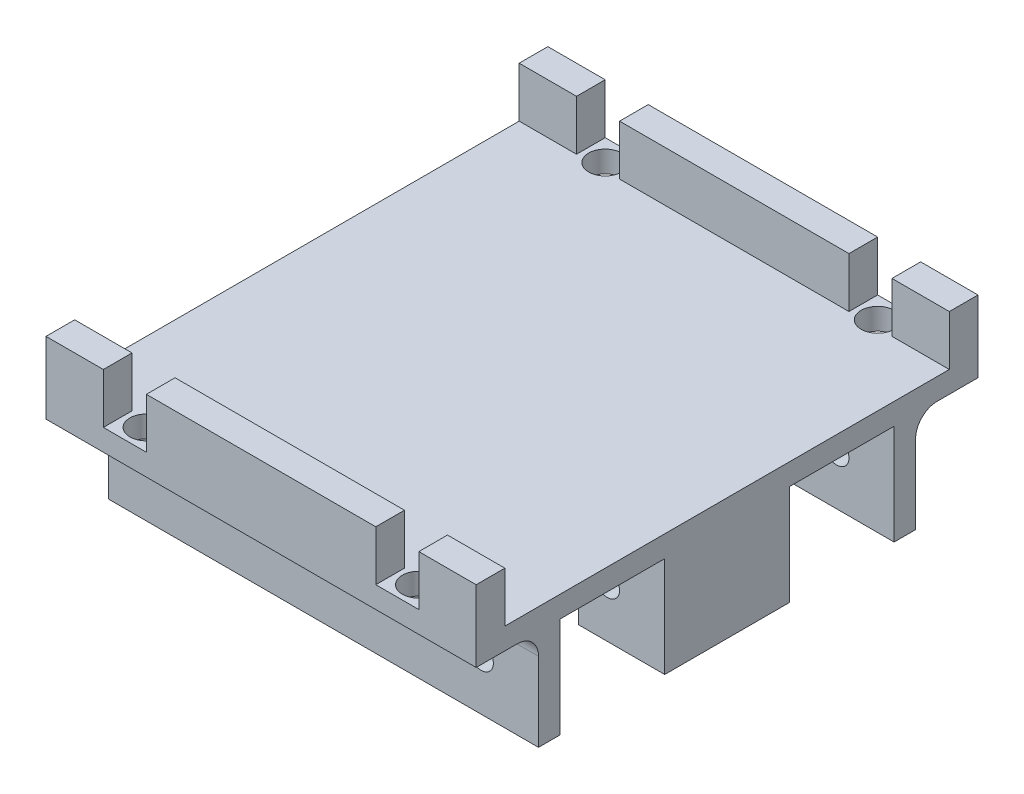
from build123d import *

# Parameters (mm, degrees)
SKETCH_1_W          = 4
SKETCH_1_H          = 7
SKETCH_1_W_2        = 3
SKETCH_1_H_2        = 14
EXTRUDE_1_DEPTH     = 60
SKETCH_2_W          = 3
SKETCH_2_H          = 11.4
EXTRUDE_2_DEPTH     = 14
SKETCH_2_3_W        = 36
SKETCH_2_3_H        = 3
CUT_EXTRUDE_1_DEPTH = 14
SKETCH_4_R          = 1.7
CUT_EXTRUDE_2_DEPTH = 87.738827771
SKETCH_5_W          = 6
SKETCH_5_H          = 4
CUT_EXTRUDE_3_DEPTH = 7
SKETCH_6_R          = 2.3
CUT_EXTRUDE_4_DEPTH = 3
FILLET_1_R          = 3


with BuildPart() as part:
    # Sketch 1 → Extrude 1 (new body)
    with BuildSketch(Plane(origin=(0, 0, 0), x_dir=(0, 0, -1), z_dir=(1, 0, 0))):
        Polygon((-76.743167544, 1.118453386), (-68.043167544, 1.118453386), (-65.043167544, 1.118453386), (-50.443167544, 1.118453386), (-47.443167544, 1.118453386), (-36.043167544, 1.118453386), (-33.043167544, 1.118453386), (-18.443167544, 1.118453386), (-15.443167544, 1.118453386), (-6.743167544, 1.118453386), (-6.743167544, 4.118453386), (-10.743167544, 4.118453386), (-72.743167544, 4.118453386), (-76.743167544, 4.118453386), align=None)
        with Locations((-74.743167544, 7.618453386)):
            Rectangle(SKETCH_1_W, SKETCH_1_H)
        with Locations((-66.543167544, -5.881546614)):
            Rectangle(SKETCH_1_W_2, SKETCH_1_H_2)
        with Locations((-48.943167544, -5.881546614)):
            Rectangle(SKETCH_1_W_2, SKETCH_1_H_2)
        with Locations((-34.543167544, -5.881546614)):
            Rectangle(SKETCH_1_W_2, SKETCH_1_H_2)
        with Locations((-16.943167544, -5.881546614)):
            Rectangle(SKETCH_1_W_2, SKETCH_1_H_2)
        with Locations((-8.743167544, 7.618453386)):
            Rectangle(SKETCH_1_W, SKETCH_1_H)
    extrude(amount=EXTRUDE_1_DEPTH)

    # Sketch 2 → Extrude 2 (add)
    with BuildSketch(Plane.XZ.offset(12.881546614)):
        with Locations((1.5, 41.743167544)):
            Rectangle(SKETCH_2_W, SKETCH_2_H)
        with Locations((58.5, 41.743167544)):
            Rectangle(SKETCH_2_W, SKETCH_2_H)
    extrude(amount=-EXTRUDE_2_DEPTH)

    # Sketch 2_3 → Cut-Extrude 1 (cut)
    with BuildSketch(Plane.XZ.offset(12.881546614)):
        with Locations((30, 48.943167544)):
            Rectangle(SKETCH_2_3_W, SKETCH_2_3_H)
        with Locations((30, 34.543167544)):
            Rectangle(SKETCH_2_3_W, SKETCH_2_3_H)
    extrude(amount=-CUT_EXTRUDE_1_DEPTH, mode=Mode.SUBTRACT)

    # Sketch 4 → Cut-Extrude 2 (cut, through all)
    with BuildSketch(Plane.XY.offset(68.043167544)):
        with Locations((8, -5.881546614)):
            Circle(SKETCH_4_R)
        with Locations((52, -5.881546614)):
            Circle(SKETCH_4_R)
    extrude(amount=-CUT_EXTRUDE_2_DEPTH, mode=Mode.SUBTRACT)

    # Sketch 5 → Cut-Extrude 3 (cut)
    with BuildSketch(Plane(origin=(0, 11.118453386, 0), x_dir=(1, 0, 0), z_dir=(0, 1, 0))):
        with Locations((11, -8.743167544)):
            Rectangle(SKETCH_5_W, SKETCH_5_H)
        with Locations((49, -8.743167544)):
            Rectangle(SKETCH_5_W, SKETCH_5_H)
        with Locations((11, -74.743167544)):
            Rectangle(SKETCH_5_W, SKETCH_5_H)
        with Locations((49, -74.743167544)):
            Rectangle(SKETCH_5_W, SKETCH_5_H)
    extrude(amount=-CUT_EXTRUDE_3_DEPTH, mode=Mode.SUBTRACT)

    # Sketch 6 → Cut-Extrude 4 (cut)
    with BuildSketch(Plane(origin=(0, 4.118453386, 0), x_dir=(1, 0, 0), z_dir=(0, 1, 0))):
        with Locations(Location((11, -9.743167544, 0), (0, 0, 270))):
            Circle(SKETCH_6_R)
        with Locations(Location((49, -9.743167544, 0), (0, 0, 270))):
            Circle(SKETCH_6_R)
        with Locations(Location((49, -73.743167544, 0), (0, 0, 270))):
            Circle(SKETCH_6_R)
        with Locations(Location((11, -73.743167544, 0), (0, 0, 270))):
            Circle(SKETCH_6_R)
    extrude(amount=-CUT_EXTRUDE_4_DEPTH, mode=Mode.SUBTRACT)

    # Fillet 1
    fillet_1_edges = [part.edges().sort_by_distance(p)[0] for p in [
        (30, 1.118453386, 15.443167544),
        (30, 1.118453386, 68.043167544),
    ]]
    fillet(fillet_1_edges, radius=FILLET_1_R)


solid = part.part
